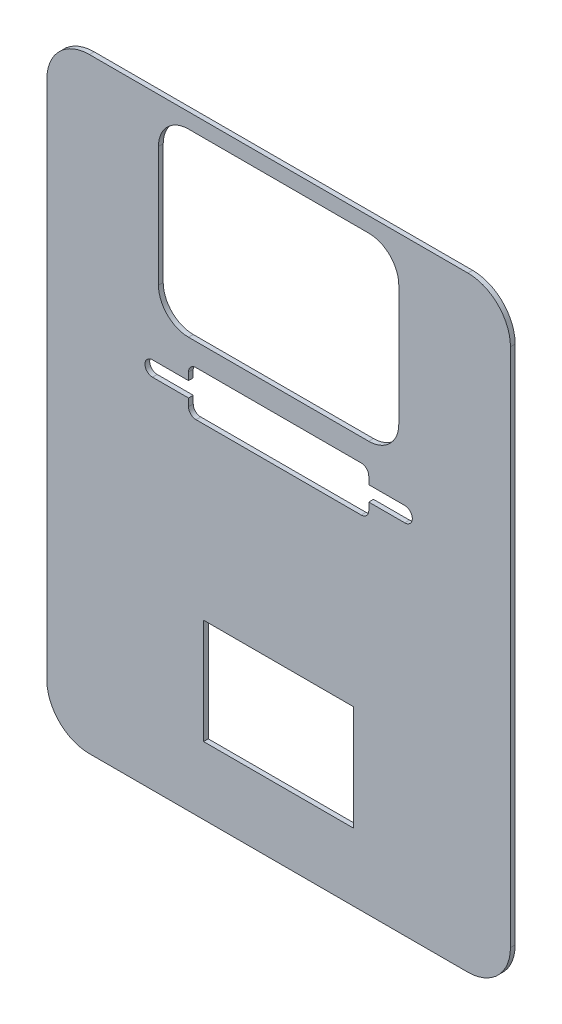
from build123d import *

# Parameters (mm, degrees)
BOSS_EXTRUDE2_DEPTH = 0.5
CUT_EXTRUDE1_REACH  = 102.326
SKETCH2_W           = 15.875
SKETCH2_H           = 11.1125


with BuildPart() as part:
    # Sketch1 → Boss-Extrude2 (new body)
    with BuildSketch(Plane.XY):
        with BuildLine():
            Line((68.5, 13.8), (68.5, 68.8))
            ThreePointArc((68.5, 68.8), (67.181980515, 71.981980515), (64, 73.3))
            Line((64, 73.3), (24, 73.3))
            ThreePointArc((24, 73.3), (20.818019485, 71.981980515), (19.5, 68.8))
            Line((19.5, 68.8), (19.5, 13.8))
            ThreePointArc((19.5, 13.8), (20.818019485, 10.618019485), (24, 9.3))
            Line((24, 9.3), (64, 9.3))
            ThreePointArc((64, 9.3), (67.181980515, 10.618019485), (68.5, 13.8))
        make_face()
    extrude(amount=-BOSS_EXTRUDE2_DEPTH)

    # Sketch2 → Cut-Extrude1 (cut, up to next)
    with BuildSketch(Plane.XY, mode=Mode.PRIVATE) as cut_extrude1_sk1:
        with BuildLine():
            Line((34.475, 52.661865), (53.525, 52.661865))
            ThreePointArc((53.525, 52.661865), (55.77006403, 53.59180097), (56.7, 55.836865))
            Line((56.7, 55.836865), (56.7, 68.536865))
            ThreePointArc((56.7, 68.536865), (55.77006403, 70.78192903), (53.525, 71.711865))
            Line((53.525, 71.711865), (34.475, 71.711865))
            ThreePointArc((34.475, 71.711865), (32.22993597, 70.78192903), (31.3, 68.536865))
            Line((31.3, 68.536865), (31.3, 55.836865))
            ThreePointArc((31.3, 55.836865), (32.22993597, 53.59180097), (34.475, 52.661865))
        make_face()
    cut_extrude1_tool1 = extrude(cut_extrude1_sk1.sketch, amount=-CUT_EXTRUDE1_REACH, mode=Mode.PRIVATE) & part.part
    # Sketch2 → Cut-Extrude1 (cut, up to next)
    with BuildSketch(Plane.XY, mode=Mode.PRIVATE) as cut_extrude1_sk2:
        with BuildLine():
            Line((35.26875, 45.511765), (52.73125, 45.511765))
            ThreePointArc((52.73125, 45.511765), (53.292516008, 45.744248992), (53.525, 46.305515))
            Line((53.525, 46.305515), (53.525, 47.099265))
            Line((53.525, 47.099265), (57.335744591, 47.099265))
            ThreePointArc((57.335744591, 47.099265), (58.129494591, 47.893015), (57.335744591, 48.686765))
            Line((57.335744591, 48.686765), (53.525, 48.686765))
            Line((53.525, 48.686765), (53.525, 49.480515))
            ThreePointArc((53.525, 49.480515), (53.292516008, 50.041781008), (52.73125, 50.274265))
            Line((52.73125, 50.274265), (35.26875, 50.274265))
            ThreePointArc((35.26875, 50.274265), (34.707483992, 50.041781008), (34.475, 49.480515))
            Line((34.475, 49.480515), (34.475, 48.686765))
            Line((34.475, 48.686765), (30.664255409, 48.686765))
            ThreePointArc((30.664255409, 48.686765), (29.870505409, 47.893015), (30.664255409, 47.099265))
            Line((30.664255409, 47.099265), (34.475, 47.099265))
            Line((34.475, 47.099265), (34.475, 46.305515))
            ThreePointArc((34.475, 46.305515), (34.707483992, 45.744248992), (35.26875, 45.511765))
        make_face()
    cut_extrude1_tool2 = extrude(cut_extrude1_sk2.sketch, amount=-CUT_EXTRUDE1_REACH, mode=Mode.PRIVATE) & part.part
    # Sketch2 → Cut-Extrude1 (cut, up to next)
    with BuildSketch(Plane.XY, mode=Mode.PRIVATE) as cut_extrude1_sk3:
        with Locations((44, 22)):
            Rectangle(SKETCH2_W, SKETCH2_H)
    cut_extrude1_tool3 = extrude(cut_extrude1_sk3.sketch, amount=-CUT_EXTRUDE1_REACH, mode=Mode.PRIVATE) & part.part
    add(cut_extrude1_tool1.solids().sort_by_distance((44, 62.186865, 0))[0], mode=Mode.SUBTRACT)
    add(cut_extrude1_tool2.solids().sort_by_distance((44, 47.893015, 0))[0], mode=Mode.SUBTRACT)
    add(cut_extrude1_tool3.solids().sort_by_distance((44, 22, 0))[0], mode=Mode.SUBTRACT)


solid = part.part
